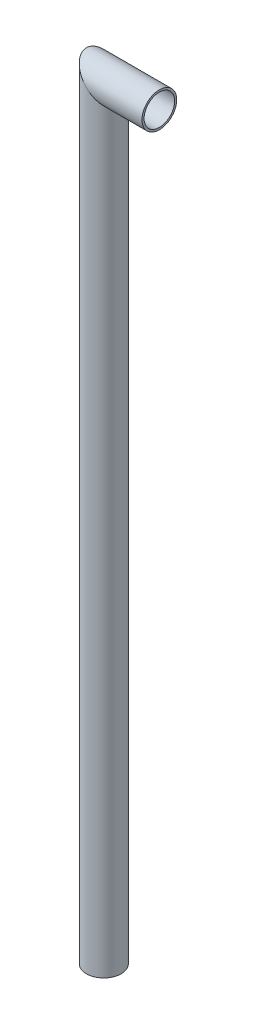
from build123d import *

# Parameters (mm, degrees)
CROQUIS1_R   = 6.25
CROQUIS1_R_2 = 5.5


with BuildPart() as part:
    # Barrer1: sweep along a path in Croquis2
    with BuildLine(Plane.XY) as barrer1_path:
        Line((0, 0), (0, 276.22))
        Line((0, 276.22), (20, 276.22))
    # Croquis1 → Barrer1 (sweep)
    with BuildSketch(Plane(origin=(0, 0, 0), x_dir=(1, 0, 0), z_dir=(0, 1, 0))):
        Circle(CROQUIS1_R)
        Circle(CROQUIS1_R_2, mode=Mode.SUBTRACT)
    sweep(path=barrer1_path.line, transition=Transition.RIGHT)


solid = part.part
